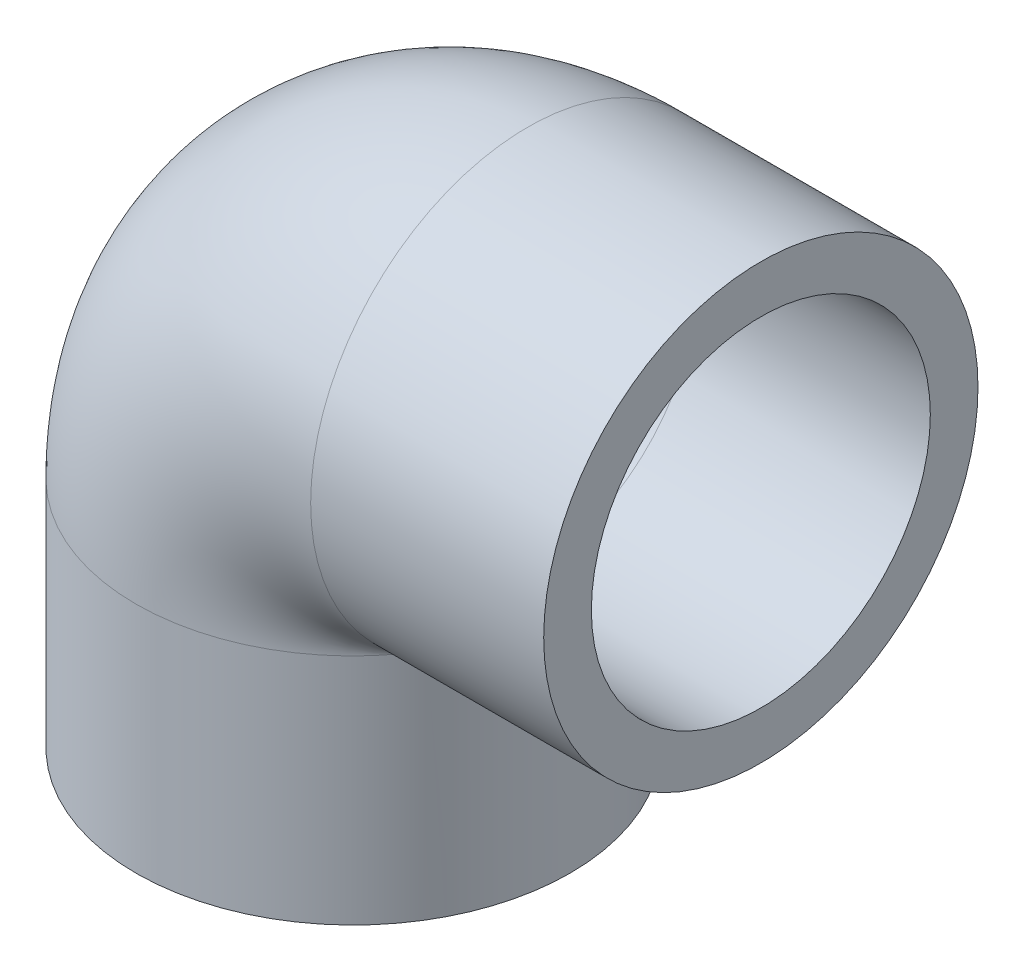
ISO-10303-21;
HEADER;
FILE_DESCRIPTION(('STEP AP214'),'2;1');
FILE_NAME('part.step','',(''),(''),'','','');
FILE_SCHEMA(('AUTOMOTIVE_DESIGN { 1 0 10303 214 1 1 1 1 }'));
ENDSEC;
DATA;
#1=APPLICATION_CONTEXT('core data for automotive mechanical design processes');
#2=APPLICATION_PROTOCOL_DEFINITION('international standard','automotive_design',2000,#1);
#3=PRODUCT_CONTEXT('',#1,'mechanical');
#4=PRODUCT('Part','Part','',(#3));
#5=PRODUCT_RELATED_PRODUCT_CATEGORY('part','',(#4));
#6=PRODUCT_DEFINITION_FORMATION('','',#4);
#7=PRODUCT_DEFINITION_CONTEXT('part definition',#1,'design');
#8=PRODUCT_DEFINITION('design','',#6,#7);
#9=PRODUCT_DEFINITION_SHAPE('','',#8);
#10=(LENGTH_UNIT() NAMED_UNIT(*) SI_UNIT(.MILLI.,.METRE.));
#11=(NAMED_UNIT(*) PLANE_ANGLE_UNIT() SI_UNIT($,.RADIAN.));
#12=(NAMED_UNIT(*) SI_UNIT($,.STERADIAN.) SOLID_ANGLE_UNIT());
#13=UNCERTAINTY_MEASURE_WITH_UNIT(LENGTH_MEASURE(1.E-05),#10,'distance_accuracy_value','');
#14=(GEOMETRIC_REPRESENTATION_CONTEXT(3) GLOBAL_UNCERTAINTY_ASSIGNED_CONTEXT((#13)) GLOBAL_UNIT_ASSIGNED_CONTEXT((#10,
#11,#12)) REPRESENTATION_CONTEXT('',''));
#15=CARTESIAN_POINT('',(0.,0.,0.));
#16=DIRECTION('',(0.,0.,1.));
#17=DIRECTION('',(1.,0.,0.));
#18=AXIS2_PLACEMENT_3D('',#15,#16,#17);
#19=CARTESIAN_POINT('',(38.5,0.,0.));
#20=DIRECTION('',(-1.,0.,0.));
#21=DIRECTION('',(0.,0.,1.));
#22=AXIS2_PLACEMENT_3D('',#19,#20,#21);
#23=CYLINDRICAL_SURFACE('',#22,20.5);
#24=CARTESIAN_POINT('',(0.,0.,0.));
#25=DIRECTION('',(-0.707106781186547,-0.707106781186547,0.));
#26=DIRECTION('',(-0.707106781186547,0.707106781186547,0.));
#27=AXIS2_PLACEMENT_3D('',#24,#25,#26);
#28=ELLIPSE('',#27,28.9913780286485,20.5);
#29=CARTESIAN_POINT('',(16.5,-16.5,-12.1655250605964));
#30=VERTEX_POINT('',#29);
#31=CARTESIAN_POINT('',(16.5,-16.5,12.1655250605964));
#32=VERTEX_POINT('',#31);
#33=EDGE_CURVE('E71',#30,#32,#28,.T.);
#34=ORIENTED_EDGE('',*,*,#33,.F.);
#35=CARTESIAN_POINT('',(16.5,0.,0.));
#36=DIRECTION('',(-1.,0.,0.));
#37=DIRECTION('',(0.,0.,1.));
#38=AXIS2_PLACEMENT_3D('',#35,#36,#37);
#39=CIRCLE('',#38,20.5);
#40=EDGE_CURVE('E53',#32,#30,#39,.T.);
#41=ORIENTED_EDGE('',*,*,#40,.F.);
#42=EDGE_LOOP('',(#34,#41));
#43=FACE_BOUND('',#42,.T.);
#44=CARTESIAN_POINT('',(38.5,0.,0.));
#45=DIRECTION('',(-1.,0.,0.));
#46=DIRECTION('',(0.,0.,1.));
#47=AXIS2_PLACEMENT_3D('',#44,#45,#46);
#48=CIRCLE('',#47,20.5);
#49=CARTESIAN_POINT('',(38.5,0.,20.5));
#50=VERTEX_POINT('',#49);
#51=EDGE_CURVE('E12',#50,#50,#48,.T.);
#52=ORIENTED_EDGE('',*,*,#51,.T.);
#53=EDGE_LOOP('',(#52));
#54=FACE_BOUND('',#53,.T.);
#55=ADVANCED_FACE('F50',(#43,#54),#23,.T.);
#56=CARTESIAN_POINT('',(38.5,0.,0.));
#57=DIRECTION('',(-1.,0.,0.));
#58=DIRECTION('',(0.,0.,1.));
#59=AXIS2_PLACEMENT_3D('',#56,#57,#58);
#60=PLANE('',#59);
#61=CARTESIAN_POINT('',(38.5,0.,0.));
#62=DIRECTION('',(-1.,0.,0.));
#63=DIRECTION('',(0.,0.,1.));
#64=AXIS2_PLACEMENT_3D('',#61,#62,#63);
#65=CIRCLE('',#64,16.);
#66=CARTESIAN_POINT('',(38.5,0.,16.));
#67=VERTEX_POINT('',#66);
#68=EDGE_CURVE('E70',#67,#67,#65,.T.);
#69=ORIENTED_EDGE('',*,*,#68,.T.);
#70=EDGE_LOOP('',(#69));
#71=FACE_BOUND('',#70,.T.);
#72=ORIENTED_EDGE('',*,*,#51,.F.);
#73=EDGE_LOOP('',(#72));
#74=FACE_BOUND('',#73,.T.);
#75=ADVANCED_FACE('F115',(#71,#74),#60,.F.);
#76=CARTESIAN_POINT('',(38.5,0.,0.));
#77=DIRECTION('',(-1.,0.,0.));
#78=DIRECTION('',(0.,0.,1.));
#79=AXIS2_PLACEMENT_3D('',#76,#77,#78);
#80=CYLINDRICAL_SURFACE('',#79,16.);
#81=ORIENTED_EDGE('',*,*,#68,.F.);
#82=EDGE_LOOP('',(#81));
#83=FACE_BOUND('',#82,.T.);
#84=CARTESIAN_POINT('',(16.5,0.,0.));
#85=DIRECTION('',(-1.,0.,0.));
#86=DIRECTION('',(0.,0.,1.));
#87=AXIS2_PLACEMENT_3D('',#84,#85,#86);
#88=CIRCLE('',#87,16.);
#89=CARTESIAN_POINT('',(16.5,16.,0.));
#90=VERTEX_POINT('',#89);
#91=EDGE_CURVE('E74',#90,#90,#88,.T.);
#92=ORIENTED_EDGE('',*,*,#91,.T.);
#93=EDGE_LOOP('',(#92));
#94=FACE_BOUND('',#93,.T.);
#95=ADVANCED_FACE('F93',(#83,#94),#80,.F.);
#96=CARTESIAN_POINT('',(0.,-38.5,0.));
#97=DIRECTION('',(0.,1.,0.));
#98=DIRECTION('',(0.,0.,1.));
#99=AXIS2_PLACEMENT_3D('',#96,#97,#98);
#100=CYLINDRICAL_SURFACE('',#99,20.5);
#101=CARTESIAN_POINT('',(0.,-38.5,0.));
#102=DIRECTION('',(0.,1.,0.));
#103=DIRECTION('',(1.,0.,0.));
#104=AXIS2_PLACEMENT_3D('',#101,#102,#103);
#105=CIRCLE('',#104,20.5);
#106=CARTESIAN_POINT('',(20.5,-38.5,0.));
#107=VERTEX_POINT('',#106);
#108=EDGE_CURVE('E75',#107,#107,#105,.T.);
#109=ORIENTED_EDGE('',*,*,#108,.T.);
#110=EDGE_LOOP('',(#109));
#111=FACE_BOUND('',#110,.T.);
#112=CARTESIAN_POINT('',(0.,-16.5,0.));
#113=DIRECTION('',(0.,1.,0.));
#114=DIRECTION('',(1.,0.,0.));
#115=AXIS2_PLACEMENT_3D('',#112,#113,#114);
#116=CIRCLE('',#115,20.5);
#117=EDGE_CURVE('E64',#30,#32,#116,.T.);
#118=ORIENTED_EDGE('',*,*,#117,.F.);
#119=ORIENTED_EDGE('',*,*,#33,.T.);
#120=EDGE_LOOP('',(#118,#119));
#121=FACE_BOUND('',#120,.T.);
#122=ADVANCED_FACE('F77',(#111,#121),#100,.T.);
#123=CARTESIAN_POINT('',(0.,-38.5,0.));
#124=DIRECTION('',(0.,1.,0.));
#125=DIRECTION('',(0.,0.,1.));
#126=AXIS2_PLACEMENT_3D('',#123,#124,#125);
#127=PLANE('',#126);
#128=CARTESIAN_POINT('',(0.,-38.5,0.));
#129=DIRECTION('',(0.,1.,0.));
#130=DIRECTION('',(0.,0.,1.));
#131=AXIS2_PLACEMENT_3D('',#128,#129,#130);
#132=CIRCLE('',#131,16.);
#133=CARTESIAN_POINT('',(0.,-38.5,16.));
#134=VERTEX_POINT('',#133);
#135=EDGE_CURVE('E78',#134,#134,#132,.T.);
#136=ORIENTED_EDGE('',*,*,#135,.T.);
#137=EDGE_LOOP('',(#136));
#138=FACE_BOUND('',#137,.T.);
#139=ORIENTED_EDGE('',*,*,#108,.F.);
#140=EDGE_LOOP('',(#139));
#141=FACE_BOUND('',#140,.T.);
#142=ADVANCED_FACE('F104',(#138,#141),#127,.F.);
#143=CARTESIAN_POINT('',(0.,-38.5,0.));
#144=DIRECTION('',(0.,1.,0.));
#145=DIRECTION('',(0.,0.,1.));
#146=AXIS2_PLACEMENT_3D('',#143,#144,#145);
#147=CYLINDRICAL_SURFACE('',#146,16.);
#148=ORIENTED_EDGE('',*,*,#135,.F.);
#149=EDGE_LOOP('',(#148));
#150=FACE_BOUND('',#149,.T.);
#151=CARTESIAN_POINT('',(0.,-16.5,0.));
#152=DIRECTION('',(0.,1.,0.));
#153=DIRECTION('',(0.,0.,1.));
#154=AXIS2_PLACEMENT_3D('',#151,#152,#153);
#155=CIRCLE('',#154,16.);
#156=CARTESIAN_POINT('',(-16.,-16.5,0.));
#157=VERTEX_POINT('',#156);
#158=EDGE_CURVE('E84',#157,#157,#155,.T.);
#159=ORIENTED_EDGE('',*,*,#158,.T.);
#160=EDGE_LOOP('',(#159));
#161=FACE_BOUND('',#160,.T.);
#162=ADVANCED_FACE('F98',(#150,#161),#147,.F.);
#163=CARTESIAN_POINT('',(16.5,-16.5,0.));
#164=DIRECTION('',(0.,0.,-1.));
#165=DIRECTION('',(-1.,0.,0.));
#166=AXIS2_PLACEMENT_3D('',#163,#164,#165);
#167=TOROIDAL_SURFACE('',#166,16.5,16.);
#168=CARTESIAN_POINT('',(16.5,-16.5,0.));
#169=DIRECTION('',(0.,0.,-1.));
#170=DIRECTION('',(-1.,0.,0.));
#171=AXIS2_PLACEMENT_3D('',#168,#169,#170);
#172=CIRCLE('',#171,32.5);
#173=EDGE_CURVE('',#157,#90,#172,.T.);
#174=ORIENTED_EDGE('',*,*,#158,.F.);
#175=ORIENTED_EDGE('',*,*,#91,.F.);
#176=ORIENTED_EDGE('',*,*,#173,.T.);
#177=ORIENTED_EDGE('',*,*,#173,.F.);
#178=EDGE_LOOP('',(#174,#176,#175,#177));
#179=FACE_BOUND('',#178,.T.);
#180=ADVANCED_FACE('F95',(#179),#167,.F.);
#181=CARTESIAN_POINT('',(0.,-16.5,0.));
#182=DIRECTION('',(0.,-1.,0.));
#183=DIRECTION('',(-1.,0.,0.));
#184=AXIS2_PLACEMENT_3D('',#181,#182,#183);
#185=CIRCLE('',#184,20.5);
#186=TRIMMED_CURVE('',#185,(PARAMETER_VALUE(-2.50626626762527)),
(PARAMETER_VALUE(2.50626626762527)),.T.,.PARAMETER.);
#187=CARTESIAN_POINT('',(16.5,-16.5,0.));
#188=DIRECTION('',(0.,0.,-1.));
#189=AXIS1_PLACEMENT('',#187,#188);
#190=SURFACE_OF_REVOLUTION('',#186,#189);
#191=ORIENTED_EDGE('',*,*,#117,.T.);
#192=ORIENTED_EDGE('',*,*,#40,.T.);
#193=EDGE_LOOP('',(#191,#192));
#194=FACE_BOUND('',#193,.T.);
#195=ADVANCED_FACE('F67',(#194),#190,.T.);
#196=CLOSED_SHELL('',(#55,#75,#95,#122,#142,#162,#180,#195));
#197=MANIFOLD_SOLID_BREP('B2',#196);
#198=ADVANCED_BREP_SHAPE_REPRESENTATION('',(#18,#197),#14);
#199=SHAPE_DEFINITION_REPRESENTATION(#9,#198);
ENDSEC;
END-ISO-10303-21;
